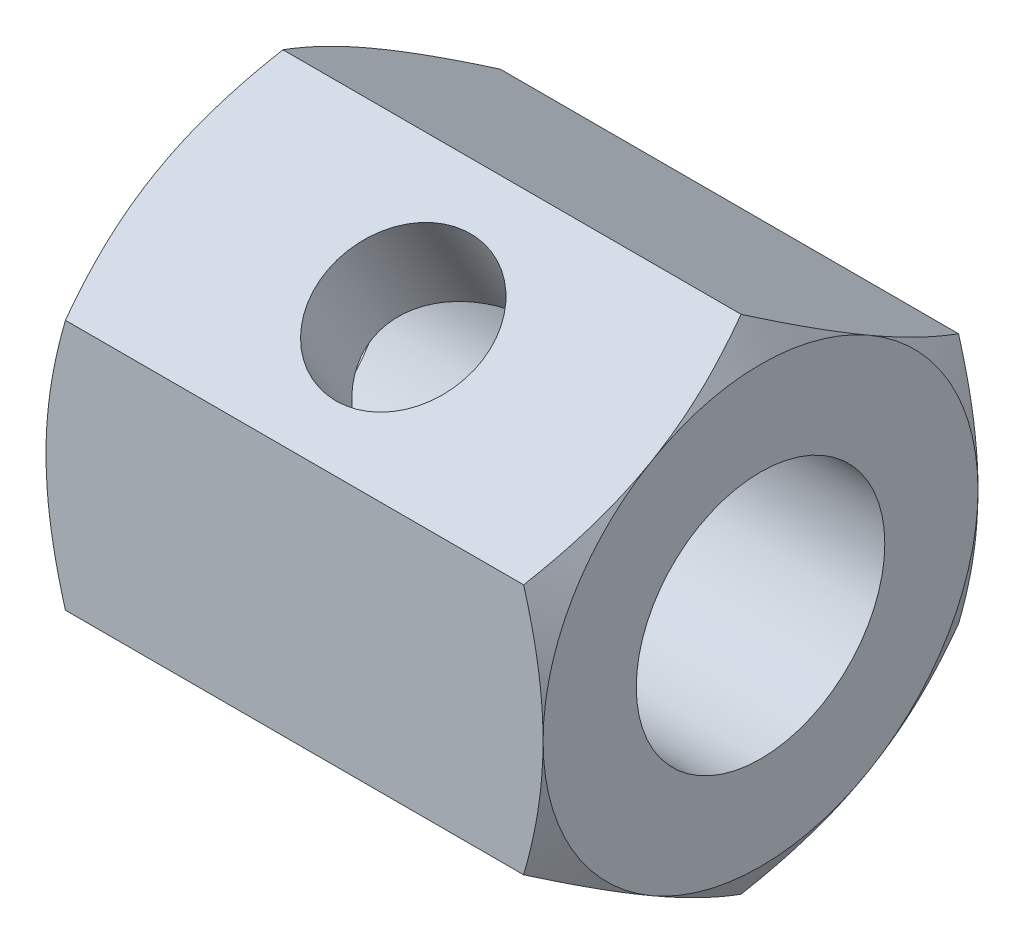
from build123d import *

# Parameters (mm, degrees)
SKETCH_1_R      = 2
EXTRUDE_1_DEPTH = 4
M3X0_5_1_REACH  = 11.674
M3X0_5_1_BORE_R = 1.25


with BuildPart() as part:
    # Sketch 1 → Extrude 1 (new, symmetric)
    with BuildSketch(Plane(origin=(0, 0, 0), x_dir=(0, 0, -1), z_dir=(1, 0, 0))):
        Polygon((0, 4.041451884), (-3.5, 2.020725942), (-3.5, -2.020725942), (0, -4.041451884), (3.5, -2.020725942), (3.5, 2.020725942), align=None)
        Circle(SKETCH_1_R, mode=Mode.SUBTRACT)
    extrude(amount=EXTRUDE_1_DEPTH, both=True)

    # Sketch 3 → Cut-Revolve 1 (revolve, cut)
    with BuildSketch(Plane(origin=(0, 0, 0), x_dir=(1, 0, 0), z_dir=(0, 1, 0))):
        Polygon((4, -3.5), (1.113248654, -8.5), (4, -8.5), align=None)
    cut_revolve_1 = revolve(axis=Axis((-5.65646548, 0, 0), (1, 0, 0)), mode=Mode.SUBTRACT)

    # Mirror 1: Cut-Revolve 1 across plane
    add(cut_revolve_1.mirror(Plane(origin=(0, 0, 0), x_dir=(0, 0, 1), z_dir=(1, 0, 0))), mode=Mode.SUBTRACT)

    # M3x0.5 _1 bore → M3x0.5 _1 (cut, up to next)
    with BuildSketch(Plane(origin=(0, 3.031088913, 1.75), x_dir=(-1, 0, 0), z_dir=(0, 0.8660254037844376, 0.5000000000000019)), mode=Mode.PRIVATE) as m3x0_5_1_sk1:
        Circle(M3X0_5_1_BORE_R)
    m3x0_5_1_tool1 = extrude(m3x0_5_1_sk1.sketch, amount=-M3X0_5_1_REACH, mode=Mode.PRIVATE) & part.part
    add(m3x0_5_1_tool1.solids().sort_by_distance((0, 3.031089, 1.75))[0], mode=Mode.SUBTRACT)


solid = part.part
